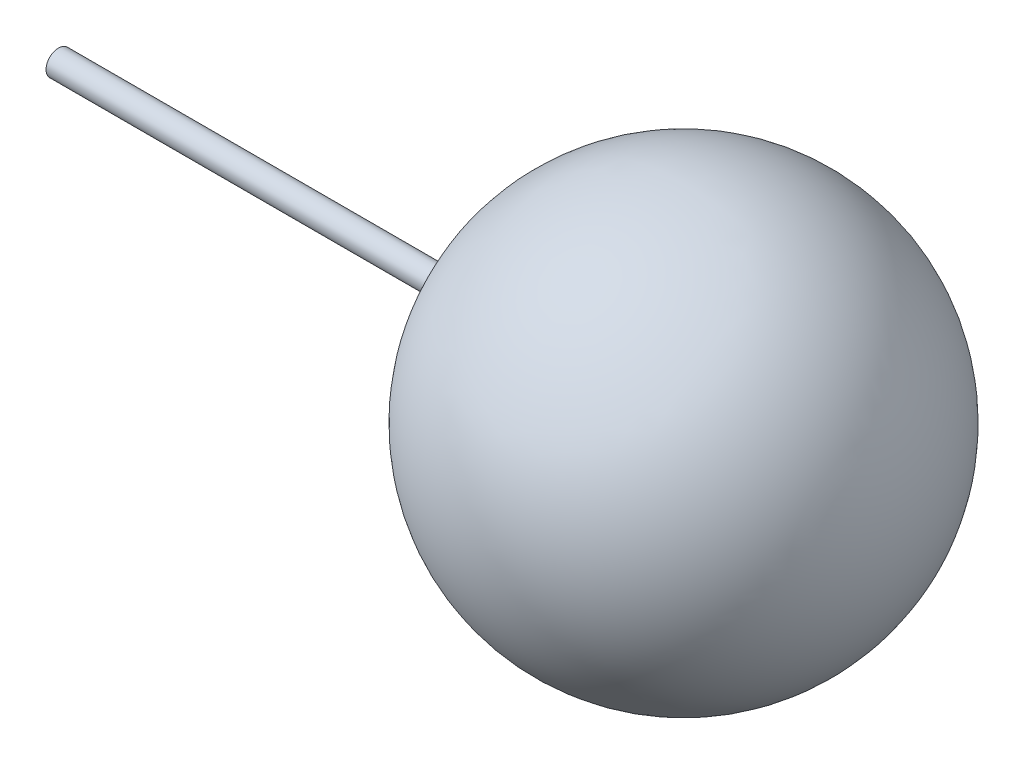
ISO-10303-21;
HEADER;
FILE_DESCRIPTION(('STEP AP214'),'2;1');
FILE_NAME('part.step','',(''),(''),'','','');
FILE_SCHEMA(('AUTOMOTIVE_DESIGN { 1 0 10303 214 1 1 1 1 }'));
ENDSEC;
DATA;
#1=APPLICATION_CONTEXT('core data for automotive mechanical design processes');
#2=APPLICATION_PROTOCOL_DEFINITION('international standard','automotive_design',2000,#1);
#3=PRODUCT_CONTEXT('',#1,'mechanical');
#4=PRODUCT('Part','Part','',(#3));
#5=PRODUCT_RELATED_PRODUCT_CATEGORY('part','',(#4));
#6=PRODUCT_DEFINITION_FORMATION('','',#4);
#7=PRODUCT_DEFINITION_CONTEXT('part definition',#1,'design');
#8=PRODUCT_DEFINITION('design','',#6,#7);
#9=PRODUCT_DEFINITION_SHAPE('','',#8);
#10=(LENGTH_UNIT() NAMED_UNIT(*) SI_UNIT(.MILLI.,.METRE.));
#11=(NAMED_UNIT(*) PLANE_ANGLE_UNIT() SI_UNIT($,.RADIAN.));
#12=(NAMED_UNIT(*) SI_UNIT($,.STERADIAN.) SOLID_ANGLE_UNIT());
#13=UNCERTAINTY_MEASURE_WITH_UNIT(LENGTH_MEASURE(1.E-05),#10,'distance_accuracy_value','');
#14=(GEOMETRIC_REPRESENTATION_CONTEXT(3) GLOBAL_UNCERTAINTY_ASSIGNED_CONTEXT((#13)) GLOBAL_UNIT_ASSIGNED_CONTEXT((#10,
#11,#12)) REPRESENTATION_CONTEXT('',''));
#15=CARTESIAN_POINT('',(0.,0.,0.));
#16=DIRECTION('',(0.,0.,1.));
#17=DIRECTION('',(1.,0.,0.));
#18=AXIS2_PLACEMENT_3D('',#15,#16,#17);
#19=CARTESIAN_POINT('',(0.,0.,0.));
#20=DIRECTION('',(-1.,0.,0.));
#21=DIRECTION('',(0.,1.,0.));
#22=AXIS2_PLACEMENT_3D('',#19,#20,#21);
#23=SPHERICAL_SURFACE('',#22,50.);
#24=CARTESIAN_POINT('',(-49.9099188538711,0.,0.));
#25=DIRECTION('',(-1.,0.,0.));
#26=DIRECTION('',(0.,0.,1.));
#27=AXIS2_PLACEMENT_3D('',#24,#25,#26);
#28=CIRCLE('',#27,2.99999999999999);
#29=CARTESIAN_POINT('',(-49.9099188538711,0.,2.99999999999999));
#30=VERTEX_POINT('',#29);
#31=EDGE_CURVE('E10',#30,#30,#28,.T.);
#32=ORIENTED_EDGE('',*,*,#31,.F.);
#33=EDGE_LOOP('',(#32));
#34=FACE_BOUND('',#33,.T.);
#35=ADVANCED_FACE('F31',(#34),#23,.T.);
#36=CARTESIAN_POINT('',(-50.,0.,0.));
#37=DIRECTION('',(-1.,0.,0.));
#38=DIRECTION('',(0.,0.,1.));
#39=AXIS2_PLACEMENT_3D('',#36,#37,#38);
#40=CYLINDRICAL_SURFACE('',#39,2.99999999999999);
#41=CARTESIAN_POINT('',(-150.,0.,0.));
#42=DIRECTION('',(-1.,0.,0.));
#43=DIRECTION('',(0.,0.,1.));
#44=AXIS2_PLACEMENT_3D('',#41,#42,#43);
#45=CIRCLE('',#44,2.99999999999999);
#46=CARTESIAN_POINT('',(-150.,0.,2.99999999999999));
#47=VERTEX_POINT('',#46);
#48=EDGE_CURVE('E37',#47,#47,#45,.T.);
#49=ORIENTED_EDGE('',*,*,#48,.F.);
#50=EDGE_LOOP('',(#49));
#51=FACE_BOUND('',#50,.T.);
#52=ORIENTED_EDGE('',*,*,#31,.T.);
#53=EDGE_LOOP('',(#52));
#54=FACE_BOUND('',#53,.T.);
#55=ADVANCED_FACE('F45',(#51,#54),#40,.T.);
#56=CARTESIAN_POINT('',(-150.,0.,0.));
#57=DIRECTION('',(1.,0.,0.));
#58=DIRECTION('',(0.,0.,-1.));
#59=AXIS2_PLACEMENT_3D('',#56,#57,#58);
#60=PLANE('',#59);
#61=ORIENTED_EDGE('',*,*,#48,.T.);
#62=EDGE_LOOP('',(#61));
#63=FACE_BOUND('',#62,.T.);
#64=ADVANCED_FACE('F43',(#63),#60,.F.);
#65=CLOSED_SHELL('',(#35,#55,#64));
#66=MANIFOLD_SOLID_BREP('B2',#65);
#67=ADVANCED_BREP_SHAPE_REPRESENTATION('',(#18,#66),#14);
#68=SHAPE_DEFINITION_REPRESENTATION(#9,#67);
ENDSEC;
END-ISO-10303-21;
